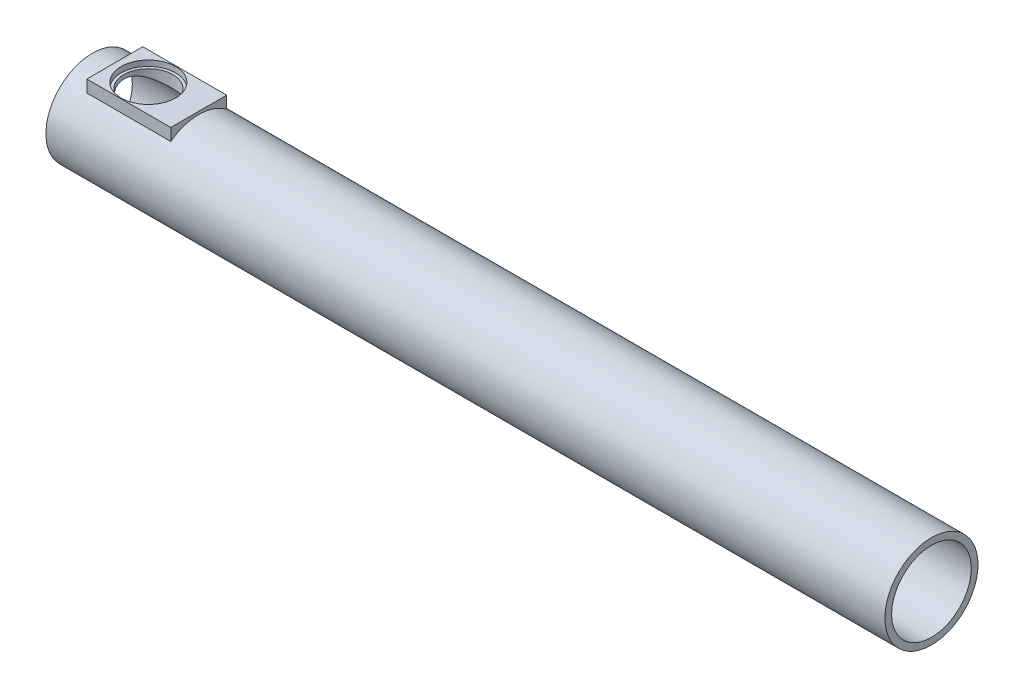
from build123d import *

# Parameters (mm, degrees)
SKETCH1_R                       = 83.185
SKETCH1_R_2                     = 71.25
BOSS_EXTRUDE1_DEPTH             = 1500
BOSS_EXTRUDE2_REACH             = 1513.489
BOSS_EXTRUDE2_END_RADIUS        = 83.185
SKETCH3_W                       = 150
SKETCH3_H                       = 100
BOSS_EXTRUDE2_DIRECTION_2_DEPTH = 5
SKETCH4_R                       = 48.75
CUT_EXTRUDE1_DEPTH              = 10
CUT_EXTRUDE2_REACH              = 1512.947
CUT_EXTRUDE2_END_RADIUS         = 71.25
SKETCH5_R                       = 43.75


with BuildPart() as part:
    # Sketch1 → Boss-Extrude1 (new body)
    with BuildSketch(Plane(origin=(0, 0, 0), x_dir=(0, 0, -1), z_dir=(1, 0, 0))):
        Circle(SKETCH1_R)
        Circle(SKETCH1_R_2, mode=Mode.SUBTRACT)
    extrude(amount=BOSS_EXTRUDE1_DEPTH)

    # Boss-Extrude2: up to this cylinder (the profile starts outside it)
    boss_extrude2_end = Plane(origin=(115, 0, 0), z_dir=(-1, 0, 0)) * Cylinder(BOSS_EXTRUDE2_END_RADIUS, 3194.348, mode=Mode.PRIVATE)
    # Sketch3 → Boss-Extrude2 (add, up to the surface)
    with BuildSketch(Plane(origin=(0, 83.185, 0), x_dir=(1, 0, 0), z_dir=(0, 1, 0)), mode=Mode.PRIVATE) as boss_extrude2_sk1:
        with Locations((115, 0)):
            Rectangle(SKETCH3_W, SKETCH3_H)
    boss_extrude2_tool1 = extrude(boss_extrude2_sk1.sketch, amount=-BOSS_EXTRUDE2_REACH, mode=Mode.PRIVATE) - boss_extrude2_end
    add(boss_extrude2_tool1.solids().sort_by_distance((115, 83.185, 0))[0])
    add(boss_extrude2_tool1.solids().sort_by_distance((115, 83.185, 0))[1])

    # Sketch3 → Boss-Extrude2 direction 2 (add)
    with BuildSketch(Plane(origin=(0, 83.185, 0), x_dir=(1, 0, 0), z_dir=(0, 1, 0))):
        with Locations((115, 0)):
            Rectangle(SKETCH3_W, SKETCH3_H)
    extrude(amount=BOSS_EXTRUDE2_DIRECTION_2_DEPTH)

    # Sketch4 → Cut-Extrude1 (cut)
    with BuildSketch(Plane(origin=(0, 88.185, 0), x_dir=(1, 0, 0), z_dir=(0, 1, 0))):
        with Locations(Location((100, 0, 0), (0, 0, 270))):
            Circle(SKETCH4_R)
    extrude(amount=-CUT_EXTRUDE1_DEPTH, mode=Mode.SUBTRACT)

    # Cut-Extrude2: up to this cylinder (the profile starts outside it)
    cut_extrude2_end = Plane(origin=(100, 0, 0), z_dir=(-1, 0, 0)) * Cylinder(CUT_EXTRUDE2_END_RADIUS, 3169.394, mode=Mode.PRIVATE)
    # Sketch5 → Cut-Extrude2 (cut, up to the surface)
    with BuildSketch(Plane(origin=(0, 78.185, 0), x_dir=(1, 0, 0), z_dir=(0, 1, 0)), mode=Mode.PRIVATE) as cut_extrude2_sk1:
        with Locations(Location((100, 0, 0), (0, 0, 270))):
            Circle(SKETCH5_R)
    cut_extrude2_tool1 = extrude(cut_extrude2_sk1.sketch, amount=-CUT_EXTRUDE2_REACH, mode=Mode.PRIVATE) - cut_extrude2_end
    add(cut_extrude2_tool1.solids().sort_by_distance((100, 78.185, 0))[0], mode=Mode.SUBTRACT)


solid = part.part
